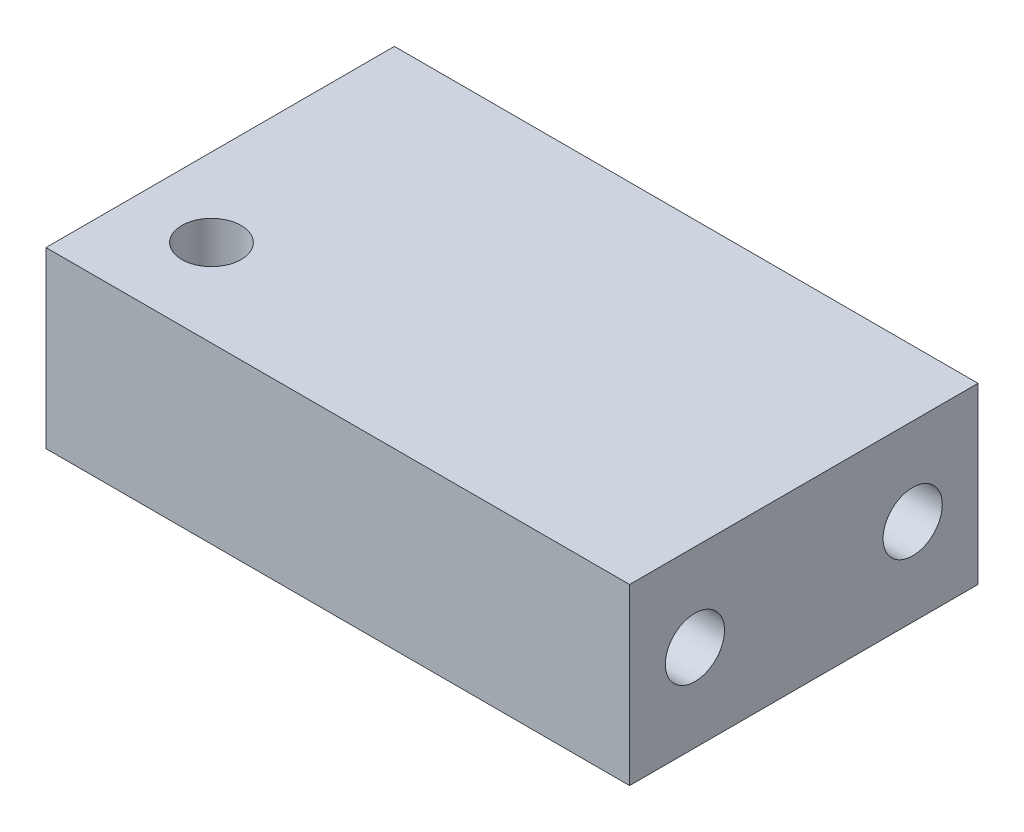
ISO-10303-21;
HEADER;
FILE_DESCRIPTION(('STEP AP214'),'2;1');
FILE_NAME('part.step','',(''),(''),'','','');
FILE_SCHEMA(('AUTOMOTIVE_DESIGN { 1 0 10303 214 1 1 1 1 }'));
ENDSEC;
DATA;
#1=APPLICATION_CONTEXT('core data for automotive mechanical design processes');
#2=APPLICATION_PROTOCOL_DEFINITION('international standard','automotive_design',2000,#1);
#3=PRODUCT_CONTEXT('',#1,'mechanical');
#4=PRODUCT('Part','Part','',(#3));
#5=PRODUCT_RELATED_PRODUCT_CATEGORY('part','',(#4));
#6=PRODUCT_DEFINITION_FORMATION('','',#4);
#7=PRODUCT_DEFINITION_CONTEXT('part definition',#1,'design');
#8=PRODUCT_DEFINITION('design','',#6,#7);
#9=PRODUCT_DEFINITION_SHAPE('','',#8);
#10=(LENGTH_UNIT() NAMED_UNIT(*) SI_UNIT(.MILLI.,.METRE.));
#11=(NAMED_UNIT(*) PLANE_ANGLE_UNIT() SI_UNIT($,.RADIAN.));
#12=(NAMED_UNIT(*) SI_UNIT($,.STERADIAN.) SOLID_ANGLE_UNIT());
#13=UNCERTAINTY_MEASURE_WITH_UNIT(LENGTH_MEASURE(1.E-05),#10,'distance_accuracy_value','');
#14=(GEOMETRIC_REPRESENTATION_CONTEXT(3) GLOBAL_UNCERTAINTY_ASSIGNED_CONTEXT((#13)) GLOBAL_UNIT_ASSIGNED_CONTEXT((#10,
#11,#12)) REPRESENTATION_CONTEXT('',''));
#15=CARTESIAN_POINT('',(0.,0.,0.));
#16=DIRECTION('',(0.,0.,1.));
#17=DIRECTION('',(1.,0.,0.));
#18=AXIS2_PLACEMENT_3D('',#15,#16,#17);
#19=CARTESIAN_POINT('',(10.7479224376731,-7.80983379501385,40.));
#20=DIRECTION('',(1.,0.,0.));
#21=DIRECTION('',(0.,0.,-1.));
#22=AXIS2_PLACEMENT_3D('',#19,#20,#21);
#23=PLANE('',#22);
#24=DIRECTION('',(0.,-1.,0.));
#25=VECTOR('',#24,1.);
#26=CARTESIAN_POINT('',(10.7479224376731,-7.80983379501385,0.));
#27=LINE('',#26,#25);
#28=CARTESIAN_POINT('',(10.7479224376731,-7.80983379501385,0.));
#29=VERTEX_POINT('',#28);
#30=CARTESIAN_POINT('',(10.7479224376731,-27.8098337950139,0.));
#31=VERTEX_POINT('',#30);
#32=EDGE_CURVE('E102',#29,#31,#27,.T.);
#33=ORIENTED_EDGE('',*,*,#32,.T.);
#34=DIRECTION('',(0.,0.,-1.));
#35=VECTOR('',#34,1.);
#36=CARTESIAN_POINT('',(10.7479224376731,-27.8098337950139,40.));
#37=LINE('',#36,#35);
#38=CARTESIAN_POINT('',(10.7479224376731,-27.8098337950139,40.));
#39=VERTEX_POINT('',#38);
#40=EDGE_CURVE('E11',#39,#31,#37,.T.);
#41=ORIENTED_EDGE('',*,*,#40,.F.);
#42=DIRECTION('',(0.,-1.,0.));
#43=VECTOR('',#42,1.);
#44=CARTESIAN_POINT('',(10.7479224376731,-7.80983379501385,40.));
#45=LINE('',#44,#43);
#46=CARTESIAN_POINT('',(10.7479224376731,-7.80983379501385,40.));
#47=VERTEX_POINT('',#46);
#48=EDGE_CURVE('E111',#47,#39,#45,.T.);
#49=ORIENTED_EDGE('',*,*,#48,.F.);
#50=DIRECTION('',(0.,0.,-1.));
#51=VECTOR('',#50,1.);
#52=CARTESIAN_POINT('',(10.7479224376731,-7.80983379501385,40.));
#53=LINE('',#52,#51);
#54=EDGE_CURVE('E117',#47,#29,#53,.T.);
#55=ORIENTED_EDGE('',*,*,#54,.T.);
#56=EDGE_LOOP('',(#33,#41,#49,#55));
#57=FACE_BOUND('',#56,.T.);
#58=ADVANCED_FACE('F32',(#57),#23,.F.);
#59=CARTESIAN_POINT('',(10.7479224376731,-27.8098337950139,40.));
#60=DIRECTION('',(0.,1.,0.));
#61=DIRECTION('',(0.,0.,1.));
#62=AXIS2_PLACEMENT_3D('',#59,#60,#61);
#63=PLANE('',#62);
#64=CARTESIAN_POINT('',(19.7479224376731,-27.8098337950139,30.));
#65=DIRECTION('',(0.,1.,0.));
#66=DIRECTION('',(0.,0.,1.));
#67=AXIS2_PLACEMENT_3D('',#64,#65,#66);
#68=CIRCLE('',#67,3.39999999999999);
#69=CARTESIAN_POINT('',(19.7479224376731,-27.8098337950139,33.4));
#70=VERTEX_POINT('',#69);
#71=EDGE_CURVE('E99',#70,#70,#68,.T.);
#72=ORIENTED_EDGE('',*,*,#71,.T.);
#73=EDGE_LOOP('',(#72));
#74=FACE_BOUND('',#73,.T.);
#75=DIRECTION('',(1.,0.,0.));
#76=VECTOR('',#75,1.);
#77=CARTESIAN_POINT('',(10.7479224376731,-27.8098337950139,0.));
#78=LINE('',#77,#76);
#79=CARTESIAN_POINT('',(77.747922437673,-27.8098337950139,0.));
#80=VERTEX_POINT('',#79);
#81=EDGE_CURVE('E105',#31,#80,#78,.T.);
#82=ORIENTED_EDGE('',*,*,#81,.T.);
#83=DIRECTION('',(0.,0.,-1.));
#84=VECTOR('',#83,1.);
#85=CARTESIAN_POINT('',(77.747922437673,-27.8098337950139,40.));
#86=LINE('',#85,#84);
#87=CARTESIAN_POINT('',(77.747922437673,-27.8098337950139,40.));
#88=VERTEX_POINT('',#87);
#89=EDGE_CURVE('E39',#88,#80,#86,.T.);
#90=ORIENTED_EDGE('',*,*,#89,.F.);
#91=DIRECTION('',(1.,0.,0.));
#92=VECTOR('',#91,1.);
#93=CARTESIAN_POINT('',(10.7479224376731,-27.8098337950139,40.));
#94=LINE('',#93,#92);
#95=EDGE_CURVE('E113',#39,#88,#94,.T.);
#96=ORIENTED_EDGE('',*,*,#95,.F.);
#97=ORIENTED_EDGE('',*,*,#40,.T.);
#98=EDGE_LOOP('',(#82,#90,#96,#97));
#99=FACE_BOUND('',#98,.T.);
#100=ADVANCED_FACE('F138',(#74,#99),#63,.F.);
#101=CARTESIAN_POINT('',(77.747922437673,-7.80983379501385,40.));
#102=DIRECTION('',(-1.,0.,0.));
#103=DIRECTION('',(0.,0.,1.));
#104=AXIS2_PLACEMENT_3D('',#101,#102,#103);
#105=PLANE('',#104);
#106=CARTESIAN_POINT('',(77.747922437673,-17.8098337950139,7.49999999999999));
#107=DIRECTION('',(1.,0.,0.));
#108=DIRECTION('',(0.,0.,-1.));
#109=AXIS2_PLACEMENT_3D('',#106,#107,#108);
#110=CIRCLE('',#109,3.39999999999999);
#111=CARTESIAN_POINT('',(77.747922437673,-17.8098337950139,4.1));
#112=VERTEX_POINT('',#111);
#113=EDGE_CURVE('E85',#112,#112,#110,.T.);
#114=ORIENTED_EDGE('',*,*,#113,.F.);
#115=EDGE_LOOP('',(#114));
#116=FACE_BOUND('',#115,.T.);
#117=CARTESIAN_POINT('',(77.747922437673,-17.8098337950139,32.5));
#118=DIRECTION('',(1.,0.,0.));
#119=DIRECTION('',(0.,0.,-1.));
#120=AXIS2_PLACEMENT_3D('',#117,#118,#119);
#121=CIRCLE('',#120,3.39999999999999);
#122=CARTESIAN_POINT('',(77.747922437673,-17.8098337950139,29.1));
#123=VERTEX_POINT('',#122);
#124=EDGE_CURVE('E93',#123,#123,#121,.T.);
#125=ORIENTED_EDGE('',*,*,#124,.F.);
#126=EDGE_LOOP('',(#125));
#127=FACE_BOUND('',#126,.T.);
#128=DIRECTION('',(0.,1.,0.));
#129=VECTOR('',#128,1.);
#130=CARTESIAN_POINT('',(77.747922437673,-7.80983379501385,0.));
#131=LINE('',#130,#129);
#132=CARTESIAN_POINT('',(77.747922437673,-7.80983379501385,0.));
#133=VERTEX_POINT('',#132);
#134=EDGE_CURVE('E107',#80,#133,#131,.T.);
#135=ORIENTED_EDGE('',*,*,#134,.T.);
#136=DIRECTION('',(0.,0.,-1.));
#137=VECTOR('',#136,1.);
#138=CARTESIAN_POINT('',(77.747922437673,-7.80983379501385,40.));
#139=LINE('',#138,#137);
#140=CARTESIAN_POINT('',(77.747922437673,-7.80983379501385,40.));
#141=VERTEX_POINT('',#140);
#142=EDGE_CURVE('E120',#141,#133,#139,.T.);
#143=ORIENTED_EDGE('',*,*,#142,.F.);
#144=DIRECTION('',(0.,1.,0.));
#145=VECTOR('',#144,1.);
#146=CARTESIAN_POINT('',(77.747922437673,-7.80983379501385,40.));
#147=LINE('',#146,#145);
#148=EDGE_CURVE('E51',#88,#141,#147,.T.);
#149=ORIENTED_EDGE('',*,*,#148,.F.);
#150=ORIENTED_EDGE('',*,*,#89,.T.);
#151=EDGE_LOOP('',(#135,#143,#149,#150));
#152=FACE_BOUND('',#151,.T.);
#153=ADVANCED_FACE('F126',(#116,#127,#152),#105,.F.);
#154=CARTESIAN_POINT('',(10.7479224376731,-7.80983379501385,40.));
#155=DIRECTION('',(0.,-1.,0.));
#156=DIRECTION('',(0.,0.,-1.));
#157=AXIS2_PLACEMENT_3D('',#154,#155,#156);
#158=PLANE('',#157);
#159=CARTESIAN_POINT('',(19.7479224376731,-7.8098337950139,30.));
#160=DIRECTION('',(0.,1.,0.));
#161=DIRECTION('',(0.,0.,1.));
#162=AXIS2_PLACEMENT_3D('',#159,#160,#161);
#163=CIRCLE('',#162,3.39999999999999);
#164=CARTESIAN_POINT('',(19.7479224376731,-7.8098337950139,33.4));
#165=VERTEX_POINT('',#164);
#166=EDGE_CURVE('E96',#165,#165,#163,.T.);
#167=ORIENTED_EDGE('',*,*,#166,.F.);
#168=EDGE_LOOP('',(#167));
#169=FACE_BOUND('',#168,.T.);
#170=DIRECTION('',(-1.,0.,0.));
#171=VECTOR('',#170,1.);
#172=CARTESIAN_POINT('',(10.7479224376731,-7.80983379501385,0.));
#173=LINE('',#172,#171);
#174=EDGE_CURVE('E109',#133,#29,#173,.T.);
#175=ORIENTED_EDGE('',*,*,#174,.T.);
#176=ORIENTED_EDGE('',*,*,#54,.F.);
#177=DIRECTION('',(-1.,0.,0.));
#178=VECTOR('',#177,1.);
#179=CARTESIAN_POINT('',(10.7479224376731,-7.80983379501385,40.));
#180=LINE('',#179,#178);
#181=EDGE_CURVE('E46',#141,#47,#180,.T.);
#182=ORIENTED_EDGE('',*,*,#181,.F.);
#183=ORIENTED_EDGE('',*,*,#142,.T.);
#184=EDGE_LOOP('',(#175,#176,#182,#183));
#185=FACE_BOUND('',#184,.T.);
#186=ADVANCED_FACE('F133',(#169,#185),#158,.F.);
#187=CARTESIAN_POINT('',(10.7479224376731,-27.8098337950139,40.));
#188=DIRECTION('',(0.,0.,1.));
#189=DIRECTION('',(1.,0.,0.));
#190=AXIS2_PLACEMENT_3D('',#187,#188,#189);
#191=PLANE('',#190);
#192=ORIENTED_EDGE('',*,*,#48,.T.);
#193=ORIENTED_EDGE('',*,*,#95,.T.);
#194=ORIENTED_EDGE('',*,*,#148,.T.);
#195=ORIENTED_EDGE('',*,*,#181,.T.);
#196=EDGE_LOOP('',(#192,#193,#194,#195));
#197=FACE_BOUND('',#196,.T.);
#198=ADVANCED_FACE('F137',(#197),#191,.T.);
#199=CARTESIAN_POINT('',(10.7479224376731,-27.8098337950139,0.));
#200=DIRECTION('',(0.,0.,1.));
#201=DIRECTION('',(1.,0.,0.));
#202=AXIS2_PLACEMENT_3D('',#199,#200,#201);
#203=PLANE('',#202);
#204=ORIENTED_EDGE('',*,*,#32,.F.);
#205=ORIENTED_EDGE('',*,*,#174,.F.);
#206=ORIENTED_EDGE('',*,*,#134,.F.);
#207=ORIENTED_EDGE('',*,*,#81,.F.);
#208=EDGE_LOOP('',(#204,#205,#206,#207));
#209=FACE_BOUND('',#208,.T.);
#210=ADVANCED_FACE('F131',(#209),#203,.F.);
#211=CARTESIAN_POINT('',(19.7479224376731,-7.8098337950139,30.));
#212=DIRECTION('',(0.,1.,0.));
#213=DIRECTION('',(0.,0.,1.));
#214=AXIS2_PLACEMENT_3D('',#211,#212,#213);
#215=CYLINDRICAL_SURFACE('',#214,3.39999999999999);
#216=ORIENTED_EDGE('',*,*,#166,.T.);
#217=EDGE_LOOP('',(#216));
#218=FACE_BOUND('',#217,.T.);
#219=ORIENTED_EDGE('',*,*,#71,.F.);
#220=EDGE_LOOP('',(#219));
#221=FACE_BOUND('',#220,.T.);
#222=ADVANCED_FACE('F155',(#218,#221),#215,.F.);
#223=CARTESIAN_POINT('',(77.747922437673,-17.8098337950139,32.5));
#224=DIRECTION('',(1.,0.,0.));
#225=DIRECTION('',(0.,0.,-1.));
#226=AXIS2_PLACEMENT_3D('',#223,#224,#225);
#227=CYLINDRICAL_SURFACE('',#226,3.39999999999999);
#228=CARTESIAN_POINT('',(41.4979224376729,-17.8098337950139,32.5));
#229=DIRECTION('',(1.,0.,0.));
#230=DIRECTION('',(0.,0.,-1.));
#231=AXIS2_PLACEMENT_3D('',#228,#229,#230);
#232=CIRCLE('',#231,3.39999999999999);
#233=CARTESIAN_POINT('',(41.4979224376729,-17.8098337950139,29.1));
#234=VERTEX_POINT('',#233);
#235=EDGE_CURVE('E88',#234,#234,#232,.T.);
#236=ORIENTED_EDGE('',*,*,#235,.F.);
#237=EDGE_LOOP('',(#236));
#238=FACE_BOUND('',#237,.T.);
#239=ORIENTED_EDGE('',*,*,#124,.T.);
#240=EDGE_LOOP('',(#239));
#241=FACE_BOUND('',#240,.T.);
#242=ADVANCED_FACE('F158',(#238,#241),#227,.F.);
#243=CARTESIAN_POINT('',(41.4979224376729,-17.8098337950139,32.5));
#244=DIRECTION('',(1.,0.,0.));
#245=DIRECTION('',(0.,0.,-1.));
#246=AXIS2_PLACEMENT_3D('',#243,#244,#245);
#247=CONICAL_SURFACE('',#246,3.39999999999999,1.02974425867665);
#248=CARTESIAN_POINT('',(39.4549963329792,-17.8098337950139,32.5));
#249=VERTEX_POINT('',#248);
#250=VERTEX_LOOP('',#249);
#251=FACE_BOUND('',#250,.T.);
#252=ORIENTED_EDGE('',*,*,#235,.T.);
#253=EDGE_LOOP('',(#252));
#254=FACE_BOUND('',#253,.T.);
#255=ADVANCED_FACE('F162',(#251,#254),#247,.F.);
#256=CARTESIAN_POINT('',(77.747922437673,-17.8098337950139,7.49999999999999));
#257=DIRECTION('',(1.,0.,0.));
#258=DIRECTION('',(0.,0.,-1.));
#259=AXIS2_PLACEMENT_3D('',#256,#257,#258);
#260=CYLINDRICAL_SURFACE('',#259,3.39999999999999);
#261=CARTESIAN_POINT('',(41.497922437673,-17.8098337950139,7.50000000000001));
#262=DIRECTION('',(1.,0.,0.));
#263=DIRECTION('',(0.,0.,-1.));
#264=AXIS2_PLACEMENT_3D('',#261,#262,#263);
#265=CIRCLE('',#264,3.39999999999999);
#266=CARTESIAN_POINT('',(41.497922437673,-17.8098337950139,4.10000000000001));
#267=VERTEX_POINT('',#266);
#268=EDGE_CURVE('E83',#267,#267,#265,.T.);
#269=ORIENTED_EDGE('',*,*,#268,.F.);
#270=EDGE_LOOP('',(#269));
#271=FACE_BOUND('',#270,.T.);
#272=ORIENTED_EDGE('',*,*,#113,.T.);
#273=EDGE_LOOP('',(#272));
#274=FACE_BOUND('',#273,.T.);
#275=ADVANCED_FACE('F79',(#271,#274),#260,.F.);
#276=CARTESIAN_POINT('',(41.497922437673,-17.8098337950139,7.50000000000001));
#277=DIRECTION('',(1.,0.,0.));
#278=DIRECTION('',(0.,0.,-1.));
#279=AXIS2_PLACEMENT_3D('',#276,#277,#278);
#280=CONICAL_SURFACE('',#279,3.39999999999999,1.02974425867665);
#281=CARTESIAN_POINT('',(39.4549963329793,-17.8098337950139,7.50000000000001));
#282=VERTEX_POINT('',#281);
#283=VERTEX_LOOP('',#282);
#284=FACE_BOUND('',#283,.T.);
#285=ORIENTED_EDGE('',*,*,#268,.T.);
#286=EDGE_LOOP('',(#285));
#287=FACE_BOUND('',#286,.T.);
#288=ADVANCED_FACE('F76',(#284,#287),#280,.F.);
#289=CLOSED_SHELL('',(#58,#100,#153,#186,#198,#210,#222,#242,#255,#275,#288));
#290=MANIFOLD_SOLID_BREP('B2',#289);
#291=ADVANCED_BREP_SHAPE_REPRESENTATION('',(#18,#290),#14);
#292=SHAPE_DEFINITION_REPRESENTATION(#9,#291);
ENDSEC;
END-ISO-10303-21;
